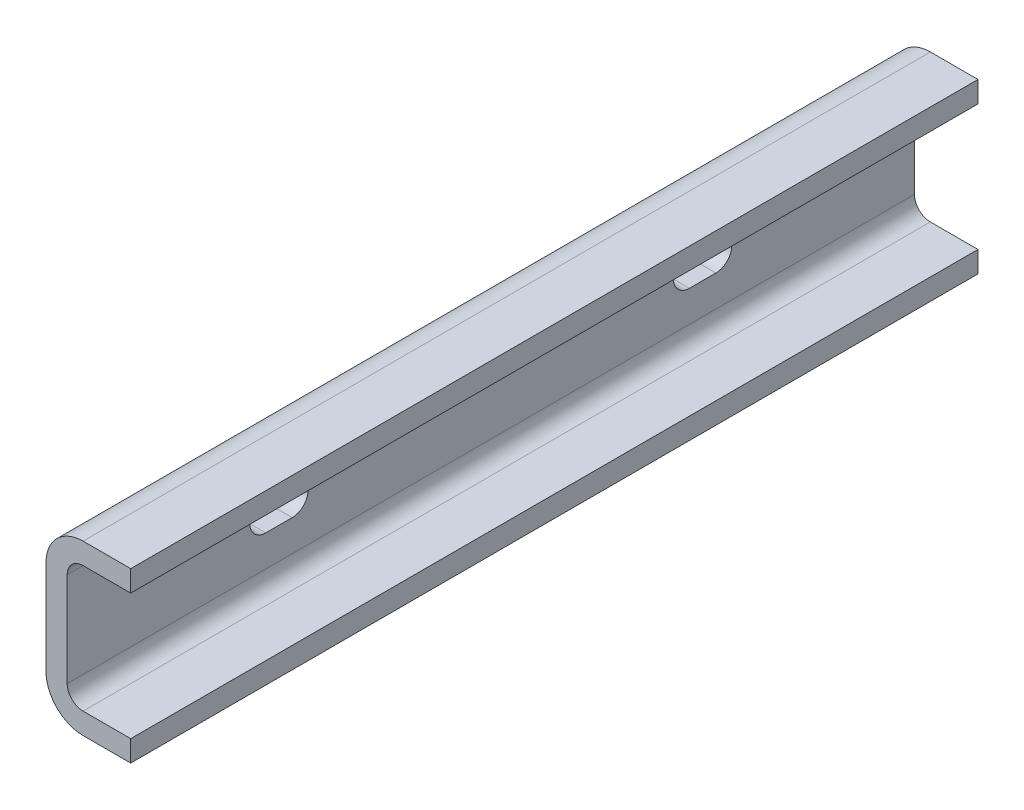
ISO-10303-21;
HEADER;
FILE_DESCRIPTION(('STEP AP214'),'2;1');
FILE_NAME('part.step','',(''),(''),'','','');
FILE_SCHEMA(('AUTOMOTIVE_DESIGN { 1 0 10303 214 1 1 1 1 }'));
ENDSEC;
DATA;
#1=APPLICATION_CONTEXT('core data for automotive mechanical design processes');
#2=APPLICATION_PROTOCOL_DEFINITION('international standard','automotive_design',2000,#1);
#3=PRODUCT_CONTEXT('',#1,'mechanical');
#4=PRODUCT('Part','Part','',(#3));
#5=PRODUCT_RELATED_PRODUCT_CATEGORY('part','',(#4));
#6=PRODUCT_DEFINITION_FORMATION('','',#4);
#7=PRODUCT_DEFINITION_CONTEXT('part definition',#1,'design');
#8=PRODUCT_DEFINITION('design','',#6,#7);
#9=PRODUCT_DEFINITION_SHAPE('','',#8);
#10=(LENGTH_UNIT() NAMED_UNIT(*) SI_UNIT(.MILLI.,.METRE.));
#11=(NAMED_UNIT(*) PLANE_ANGLE_UNIT() SI_UNIT($,.RADIAN.));
#12=(NAMED_UNIT(*) SI_UNIT($,.STERADIAN.) SOLID_ANGLE_UNIT());
#13=UNCERTAINTY_MEASURE_WITH_UNIT(LENGTH_MEASURE(1.E-05),#10,'distance_accuracy_value','');
#14=(GEOMETRIC_REPRESENTATION_CONTEXT(3) GLOBAL_UNCERTAINTY_ASSIGNED_CONTEXT((#13)) GLOBAL_UNIT_ASSIGNED_CONTEXT((#10,
#11,#12)) REPRESENTATION_CONTEXT('',''));
#15=CARTESIAN_POINT('',(0.,0.,0.));
#16=DIRECTION('',(0.,0.,1.));
#17=DIRECTION('',(1.,0.,0.));
#18=AXIS2_PLACEMENT_3D('',#15,#16,#17);
#19=CARTESIAN_POINT('',(7.,11.9,-160.));
#20=DIRECTION('',(0.,-1.,0.));
#21=DIRECTION('',(0.,0.,-1.));
#22=AXIS2_PLACEMENT_3D('',#19,#20,#21);
#23=PLANE('',#22);
#24=DIRECTION('',(1.,0.,0.));
#25=VECTOR('',#24,1.);
#26=CARTESIAN_POINT('',(7.,11.9,0.));
#27=LINE('',#26,#25);
#28=CARTESIAN_POINT('',(7.,11.9,0.));
#29=VERTEX_POINT('',#28);
#30=CARTESIAN_POINT('',(16.,11.9,0.));
#31=VERTEX_POINT('',#30);
#32=EDGE_CURVE('E262',#29,#31,#27,.T.);
#33=ORIENTED_EDGE('',*,*,#32,.F.);
#34=DIRECTION('',(0.,0.,1.));
#35=VECTOR('',#34,1.);
#36=CARTESIAN_POINT('',(7.,11.9,-160.));
#37=LINE('',#36,#35);
#38=CARTESIAN_POINT('',(7.,11.9,-160.));
#39=VERTEX_POINT('',#38);
#40=EDGE_CURVE('E11',#39,#29,#37,.T.);
#41=ORIENTED_EDGE('',*,*,#40,.F.);
#42=DIRECTION('',(1.,0.,0.));
#43=VECTOR('',#42,1.);
#44=CARTESIAN_POINT('',(7.,11.9,-160.));
#45=LINE('',#44,#43);
#46=CARTESIAN_POINT('',(16.,11.9,-160.));
#47=VERTEX_POINT('',#46);
#48=EDGE_CURVE('E272',#39,#47,#45,.T.);
#49=ORIENTED_EDGE('',*,*,#48,.T.);
#50=DIRECTION('',(0.,0.,1.));
#51=VECTOR('',#50,1.);
#52=CARTESIAN_POINT('',(16.,11.9,-160.));
#53=LINE('',#52,#51);
#54=EDGE_CURVE('E42',#47,#31,#53,.T.);
#55=ORIENTED_EDGE('',*,*,#54,.T.);
#56=EDGE_LOOP('',(#33,#41,#49,#55));
#57=FACE_BOUND('',#56,.T.);
#58=ADVANCED_FACE('F39',(#57),#23,.T.);
#59=CARTESIAN_POINT('',(7.00000000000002,8.89999999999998,-160.));
#60=DIRECTION('',(0.,0.,1.));
#61=DIRECTION('',(1.,0.,0.));
#62=AXIS2_PLACEMENT_3D('',#59,#60,#61);
#63=CYLINDRICAL_SURFACE('',#62,3.00000000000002);
#64=CARTESIAN_POINT('',(7.00000000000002,8.89999999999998,0.));
#65=DIRECTION('',(0.,0.,-1.));
#66=DIRECTION('',(-1.,0.,0.));
#67=AXIS2_PLACEMENT_3D('',#64,#65,#66);
#68=CIRCLE('',#67,3.00000000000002);
#69=CARTESIAN_POINT('',(4.,8.89999999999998,0.));
#70=VERTEX_POINT('',#69);
#71=EDGE_CURVE('E277',#70,#29,#68,.T.);
#72=ORIENTED_EDGE('',*,*,#71,.F.);
#73=DIRECTION('',(0.,0.,1.));
#74=VECTOR('',#73,1.);
#75=CARTESIAN_POINT('',(4.,8.89999999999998,-160.));
#76=LINE('',#75,#74);
#77=CARTESIAN_POINT('',(4.,8.89999999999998,-160.));
#78=VERTEX_POINT('',#77);
#79=EDGE_CURVE('E48',#78,#70,#76,.T.);
#80=ORIENTED_EDGE('',*,*,#79,.F.);
#81=CARTESIAN_POINT('',(7.00000000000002,8.89999999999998,-160.));
#82=DIRECTION('',(0.,0.,-1.));
#83=DIRECTION('',(-1.,0.,0.));
#84=AXIS2_PLACEMENT_3D('',#81,#82,#83);
#85=CIRCLE('',#84,3.00000000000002);
#86=EDGE_CURVE('E317',#78,#39,#85,.T.);
#87=ORIENTED_EDGE('',*,*,#86,.T.);
#88=ORIENTED_EDGE('',*,*,#40,.T.);
#89=EDGE_LOOP('',(#72,#80,#87,#88));
#90=FACE_BOUND('',#89,.T.);
#91=ADVANCED_FACE('F406',(#90),#63,.F.);
#92=CARTESIAN_POINT('',(4.,-8.9,-160.));
#93=DIRECTION('',(1.,0.,0.));
#94=DIRECTION('',(0.,0.,-1.));
#95=AXIS2_PLACEMENT_3D('',#92,#93,#94);
#96=PLANE('',#95);
#97=CARTESIAN_POINT('',(4.,0.,-117.5));
#98=DIRECTION('',(1.,0.,0.));
#99=DIRECTION('',(0.,0.,-1.));
#100=AXIS2_PLACEMENT_3D('',#97,#98,#99);
#101=CIRCLE('',#100,3.);
#102=CARTESIAN_POINT('',(4.,3.,-117.5));
#103=VERTEX_POINT('',#102);
#104=CARTESIAN_POINT('',(4.,-3.,-117.5));
#105=VERTEX_POINT('',#104);
#106=EDGE_CURVE('E56',#103,#105,#101,.T.);
#107=ORIENTED_EDGE('',*,*,#106,.F.);
#108=DIRECTION('',(0.,0.,1.));
#109=VECTOR('',#108,1.);
#110=CARTESIAN_POINT('',(4.,3.,-117.5));
#111=LINE('',#110,#109);
#112=CARTESIAN_POINT('',(4.,3.,-122.5));
#113=VERTEX_POINT('',#112);
#114=EDGE_CURVE('E198',#113,#103,#111,.T.);
#115=ORIENTED_EDGE('',*,*,#114,.F.);
#116=CARTESIAN_POINT('',(4.,0.,-122.5));
#117=DIRECTION('',(1.,0.,0.));
#118=DIRECTION('',(0.,0.,1.));
#119=AXIS2_PLACEMENT_3D('',#116,#117,#118);
#120=CIRCLE('',#119,3.);
#121=CARTESIAN_POINT('',(4.,-3.,-122.5));
#122=VERTEX_POINT('',#121);
#123=EDGE_CURVE('E204',#122,#113,#120,.T.);
#124=ORIENTED_EDGE('',*,*,#123,.F.);
#125=DIRECTION('',(0.,0.,-1.));
#126=VECTOR('',#125,1.);
#127=CARTESIAN_POINT('',(4.,-3.,-117.5));
#128=LINE('',#127,#126);
#129=EDGE_CURVE('E213',#105,#122,#128,.T.);
#130=ORIENTED_EDGE('',*,*,#129,.F.);
#131=EDGE_LOOP('',(#107,#115,#124,#130));
#132=FACE_BOUND('',#131,.T.);
#133=CARTESIAN_POINT('',(4.,0.,-37.5));
#134=DIRECTION('',(1.,0.,0.));
#135=DIRECTION('',(0.,0.,-1.));
#136=AXIS2_PLACEMENT_3D('',#133,#134,#135);
#137=CIRCLE('',#136,3.);
#138=CARTESIAN_POINT('',(4.,3.,-37.5));
#139=VERTEX_POINT('',#138);
#140=CARTESIAN_POINT('',(4.,-3.,-37.5));
#141=VERTEX_POINT('',#140);
#142=EDGE_CURVE('E222',#139,#141,#137,.T.);
#143=ORIENTED_EDGE('',*,*,#142,.F.);
#144=DIRECTION('',(0.,0.,1.));
#145=VECTOR('',#144,1.);
#146=CARTESIAN_POINT('',(4.,3.,-37.5));
#147=LINE('',#146,#145);
#148=CARTESIAN_POINT('',(4.,3.,-42.5));
#149=VERTEX_POINT('',#148);
#150=EDGE_CURVE('E233',#149,#139,#147,.T.);
#151=ORIENTED_EDGE('',*,*,#150,.F.);
#152=CARTESIAN_POINT('',(4.,0.,-42.5));
#153=DIRECTION('',(1.,0.,0.));
#154=DIRECTION('',(0.,0.,1.));
#155=AXIS2_PLACEMENT_3D('',#152,#153,#154);
#156=CIRCLE('',#155,3.);
#157=CARTESIAN_POINT('',(4.,-3.,-42.5));
#158=VERTEX_POINT('',#157);
#159=EDGE_CURVE('E252',#158,#149,#156,.T.);
#160=ORIENTED_EDGE('',*,*,#159,.F.);
#161=DIRECTION('',(0.,0.,-1.));
#162=VECTOR('',#161,1.);
#163=CARTESIAN_POINT('',(4.,-3.,-37.5));
#164=LINE('',#163,#162);
#165=EDGE_CURVE('E248',#141,#158,#164,.T.);
#166=ORIENTED_EDGE('',*,*,#165,.F.);
#167=EDGE_LOOP('',(#143,#151,#160,#166));
#168=FACE_BOUND('',#167,.T.);
#169=DIRECTION('',(0.,1.,0.));
#170=VECTOR('',#169,1.);
#171=CARTESIAN_POINT('',(4.,-8.9,0.));
#172=LINE('',#171,#170);
#173=CARTESIAN_POINT('',(4.,-8.9,0.));
#174=VERTEX_POINT('',#173);
#175=EDGE_CURVE('E360',#174,#70,#172,.T.);
#176=ORIENTED_EDGE('',*,*,#175,.F.);
#177=DIRECTION('',(0.,0.,1.));
#178=VECTOR('',#177,1.);
#179=CARTESIAN_POINT('',(4.,-8.9,-160.));
#180=LINE('',#179,#178);
#181=CARTESIAN_POINT('',(4.,-8.9,-160.));
#182=VERTEX_POINT('',#181);
#183=EDGE_CURVE('E368',#182,#174,#180,.T.);
#184=ORIENTED_EDGE('',*,*,#183,.F.);
#185=DIRECTION('',(0.,1.,0.));
#186=VECTOR('',#185,1.);
#187=CARTESIAN_POINT('',(4.,-8.9,-160.));
#188=LINE('',#187,#186);
#189=EDGE_CURVE('E313',#182,#78,#188,.T.);
#190=ORIENTED_EDGE('',*,*,#189,.T.);
#191=ORIENTED_EDGE('',*,*,#79,.T.);
#192=EDGE_LOOP('',(#176,#184,#190,#191));
#193=FACE_BOUND('',#192,.T.);
#194=ADVANCED_FACE('F442',(#132,#168,#193),#96,.T.);
#195=CARTESIAN_POINT('',(7.,-8.9,-160.));
#196=DIRECTION('',(0.,0.,1.));
#197=DIRECTION('',(1.,0.,0.));
#198=AXIS2_PLACEMENT_3D('',#195,#196,#197);
#199=CYLINDRICAL_SURFACE('',#198,3.);
#200=CARTESIAN_POINT('',(7.,-8.9,0.));
#201=DIRECTION('',(0.,0.,-1.));
#202=DIRECTION('',(-1.,0.,0.));
#203=AXIS2_PLACEMENT_3D('',#200,#201,#202);
#204=CIRCLE('',#203,3.);
#205=CARTESIAN_POINT('',(7.,-11.9,0.));
#206=VERTEX_POINT('',#205);
#207=EDGE_CURVE('E356',#206,#174,#204,.T.);
#208=ORIENTED_EDGE('',*,*,#207,.F.);
#209=DIRECTION('',(0.,0.,1.));
#210=VECTOR('',#209,1.);
#211=CARTESIAN_POINT('',(7.,-11.9,-160.));
#212=LINE('',#211,#210);
#213=CARTESIAN_POINT('',(7.,-11.9,-160.));
#214=VERTEX_POINT('',#213);
#215=EDGE_CURVE('E371',#214,#206,#212,.T.);
#216=ORIENTED_EDGE('',*,*,#215,.F.);
#217=CARTESIAN_POINT('',(7.,-8.9,-160.));
#218=DIRECTION('',(0.,0.,-1.));
#219=DIRECTION('',(-1.,0.,0.));
#220=AXIS2_PLACEMENT_3D('',#217,#218,#219);
#221=CIRCLE('',#220,3.);
#222=EDGE_CURVE('E309',#214,#182,#221,.T.);
#223=ORIENTED_EDGE('',*,*,#222,.T.);
#224=ORIENTED_EDGE('',*,*,#183,.T.);
#225=EDGE_LOOP('',(#208,#216,#223,#224));
#226=FACE_BOUND('',#225,.T.);
#227=ADVANCED_FACE('F439',(#226),#199,.F.);
#228=CARTESIAN_POINT('',(16.,-11.9,-160.));
#229=DIRECTION('',(0.,1.,0.));
#230=DIRECTION('',(0.,0.,1.));
#231=AXIS2_PLACEMENT_3D('',#228,#229,#230);
#232=PLANE('',#231);
#233=DIRECTION('',(-1.,0.,0.));
#234=VECTOR('',#233,1.);
#235=CARTESIAN_POINT('',(16.,-11.9,0.));
#236=LINE('',#235,#234);
#237=CARTESIAN_POINT('',(16.,-11.9,0.));
#238=VERTEX_POINT('',#237);
#239=EDGE_CURVE('E352',#238,#206,#236,.T.);
#240=ORIENTED_EDGE('',*,*,#239,.F.);
#241=DIRECTION('',(0.,0.,1.));
#242=VECTOR('',#241,1.);
#243=CARTESIAN_POINT('',(16.,-11.9,-160.));
#244=LINE('',#243,#242);
#245=CARTESIAN_POINT('',(16.,-11.9,-160.));
#246=VERTEX_POINT('',#245);
#247=EDGE_CURVE('E374',#246,#238,#244,.T.);
#248=ORIENTED_EDGE('',*,*,#247,.F.);
#249=DIRECTION('',(-1.,0.,0.));
#250=VECTOR('',#249,1.);
#251=CARTESIAN_POINT('',(16.,-11.9,-160.));
#252=LINE('',#251,#250);
#253=EDGE_CURVE('E305',#246,#214,#252,.T.);
#254=ORIENTED_EDGE('',*,*,#253,.T.);
#255=ORIENTED_EDGE('',*,*,#215,.T.);
#256=EDGE_LOOP('',(#240,#248,#254,#255));
#257=FACE_BOUND('',#256,.T.);
#258=ADVANCED_FACE('F436',(#257),#232,.T.);
#259=CARTESIAN_POINT('',(16.,-15.9,-160.));
#260=DIRECTION('',(1.,0.,0.));
#261=DIRECTION('',(0.,0.,-1.));
#262=AXIS2_PLACEMENT_3D('',#259,#260,#261);
#263=PLANE('',#262);
#264=DIRECTION('',(0.,1.,0.));
#265=VECTOR('',#264,1.);
#266=CARTESIAN_POINT('',(16.,-15.9,0.));
#267=LINE('',#266,#265);
#268=CARTESIAN_POINT('',(16.,-15.9,0.));
#269=VERTEX_POINT('',#268);
#270=EDGE_CURVE('E348',#269,#238,#267,.T.);
#271=ORIENTED_EDGE('',*,*,#270,.F.);
#272=DIRECTION('',(0.,0.,1.));
#273=VECTOR('',#272,1.);
#274=CARTESIAN_POINT('',(16.,-15.9,-160.));
#275=LINE('',#274,#273);
#276=CARTESIAN_POINT('',(16.,-15.9,-160.));
#277=VERTEX_POINT('',#276);
#278=EDGE_CURVE('E377',#277,#269,#275,.T.);
#279=ORIENTED_EDGE('',*,*,#278,.F.);
#280=DIRECTION('',(0.,1.,0.));
#281=VECTOR('',#280,1.);
#282=CARTESIAN_POINT('',(16.,-15.9,-160.));
#283=LINE('',#282,#281);
#284=EDGE_CURVE('E301',#277,#246,#283,.T.);
#285=ORIENTED_EDGE('',*,*,#284,.T.);
#286=ORIENTED_EDGE('',*,*,#247,.T.);
#287=EDGE_LOOP('',(#271,#279,#285,#286));
#288=FACE_BOUND('',#287,.T.);
#289=ADVANCED_FACE('F432',(#288),#263,.T.);
#290=CARTESIAN_POINT('',(7.,-15.9,-160.));
#291=DIRECTION('',(0.,-1.,0.));
#292=DIRECTION('',(0.,0.,-1.));
#293=AXIS2_PLACEMENT_3D('',#290,#291,#292);
#294=PLANE('',#293);
#295=DIRECTION('',(1.,0.,0.));
#296=VECTOR('',#295,1.);
#297=CARTESIAN_POINT('',(7.,-15.9,0.));
#298=LINE('',#297,#296);
#299=CARTESIAN_POINT('',(7.,-15.9,0.));
#300=VERTEX_POINT('',#299);
#301=EDGE_CURVE('E344',#300,#269,#298,.T.);
#302=ORIENTED_EDGE('',*,*,#301,.F.);
#303=DIRECTION('',(0.,0.,1.));
#304=VECTOR('',#303,1.);
#305=CARTESIAN_POINT('',(7.,-15.9,-160.));
#306=LINE('',#305,#304);
#307=CARTESIAN_POINT('',(7.,-15.9,-160.));
#308=VERTEX_POINT('',#307);
#309=EDGE_CURVE('E380',#308,#300,#306,.T.);
#310=ORIENTED_EDGE('',*,*,#309,.F.);
#311=DIRECTION('',(1.,0.,0.));
#312=VECTOR('',#311,1.);
#313=CARTESIAN_POINT('',(7.,-15.9,-160.));
#314=LINE('',#313,#312);
#315=EDGE_CURVE('E297',#308,#277,#314,.T.);
#316=ORIENTED_EDGE('',*,*,#315,.T.);
#317=ORIENTED_EDGE('',*,*,#278,.T.);
#318=EDGE_LOOP('',(#302,#310,#316,#317));
#319=FACE_BOUND('',#318,.T.);
#320=ADVANCED_FACE('F428',(#319),#294,.T.);
#321=CARTESIAN_POINT('',(6.99999999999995,-8.90000000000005,-160.));
#322=DIRECTION('',(0.,0.,1.));
#323=DIRECTION('',(1.,0.,0.));
#324=AXIS2_PLACEMENT_3D('',#321,#322,#323);
#325=CYLINDRICAL_SURFACE('',#324,6.99999999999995);
#326=CARTESIAN_POINT('',(6.99999999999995,-8.90000000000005,0.));
#327=DIRECTION('',(0.,0.,1.));
#328=DIRECTION('',(1.,0.,0.));
#329=AXIS2_PLACEMENT_3D('',#326,#327,#328);
#330=CIRCLE('',#329,6.99999999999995);
#331=CARTESIAN_POINT('',(0.,-8.90000000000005,0.));
#332=VERTEX_POINT('',#331);
#333=EDGE_CURVE('E340',#332,#300,#330,.T.);
#334=ORIENTED_EDGE('',*,*,#333,.F.);
#335=DIRECTION('',(0.,0.,1.));
#336=VECTOR('',#335,1.);
#337=CARTESIAN_POINT('',(0.,-8.90000000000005,-160.));
#338=LINE('',#337,#336);
#339=CARTESIAN_POINT('',(0.,-8.90000000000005,-160.));
#340=VERTEX_POINT('',#339);
#341=EDGE_CURVE('E383',#340,#332,#338,.T.);
#342=ORIENTED_EDGE('',*,*,#341,.F.);
#343=CARTESIAN_POINT('',(6.99999999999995,-8.90000000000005,-160.));
#344=DIRECTION('',(0.,0.,1.));
#345=DIRECTION('',(1.,0.,0.));
#346=AXIS2_PLACEMENT_3D('',#343,#344,#345);
#347=CIRCLE('',#346,6.99999999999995);
#348=EDGE_CURVE('E293',#340,#308,#347,.T.);
#349=ORIENTED_EDGE('',*,*,#348,.T.);
#350=ORIENTED_EDGE('',*,*,#309,.T.);
#351=EDGE_LOOP('',(#334,#342,#349,#350));
#352=FACE_BOUND('',#351,.T.);
#353=ADVANCED_FACE('F424',(#352),#325,.T.);
#354=CARTESIAN_POINT('',(0.,8.9,-160.));
#355=DIRECTION('',(-1.,0.,0.));
#356=DIRECTION('',(0.,-1.,0.));
#357=AXIS2_PLACEMENT_3D('',#354,#355,#356);
#358=PLANE('',#357);
#359=CARTESIAN_POINT('',(0.,0.,-117.5));
#360=DIRECTION('',(1.,0.,0.));
#361=DIRECTION('',(0.,0.,-1.));
#362=AXIS2_PLACEMENT_3D('',#359,#360,#361);
#363=CIRCLE('',#362,3.);
#364=CARTESIAN_POINT('',(0.,3.,-117.5));
#365=VERTEX_POINT('',#364);
#366=CARTESIAN_POINT('',(0.,-3.,-117.5));
#367=VERTEX_POINT('',#366);
#368=EDGE_CURVE('E179',#365,#367,#363,.T.);
#369=ORIENTED_EDGE('',*,*,#368,.T.);
#370=DIRECTION('',(0.,0.,-1.));
#371=VECTOR('',#370,1.);
#372=CARTESIAN_POINT('',(0.,-3.,-117.5));
#373=LINE('',#372,#371);
#374=CARTESIAN_POINT('',(0.,-3.,-122.5));
#375=VERTEX_POINT('',#374);
#376=EDGE_CURVE('E189',#367,#375,#373,.T.);
#377=ORIENTED_EDGE('',*,*,#376,.T.);
#378=CARTESIAN_POINT('',(0.,0.,-122.5));
#379=DIRECTION('',(1.,0.,0.));
#380=DIRECTION('',(0.,0.,1.));
#381=AXIS2_PLACEMENT_3D('',#378,#379,#380);
#382=CIRCLE('',#381,3.);
#383=CARTESIAN_POINT('',(0.,3.,-122.5));
#384=VERTEX_POINT('',#383);
#385=EDGE_CURVE('E64',#375,#384,#382,.T.);
#386=ORIENTED_EDGE('',*,*,#385,.T.);
#387=DIRECTION('',(0.,0.,1.));
#388=VECTOR('',#387,1.);
#389=CARTESIAN_POINT('',(0.,3.,-117.5));
#390=LINE('',#389,#388);
#391=EDGE_CURVE('E186',#384,#365,#390,.T.);
#392=ORIENTED_EDGE('',*,*,#391,.T.);
#393=EDGE_LOOP('',(#369,#377,#386,#392));
#394=FACE_BOUND('',#393,.T.);
#395=CARTESIAN_POINT('',(0.,0.,-37.5));
#396=DIRECTION('',(1.,0.,0.));
#397=DIRECTION('',(0.,0.,-1.));
#398=AXIS2_PLACEMENT_3D('',#395,#396,#397);
#399=CIRCLE('',#398,3.);
#400=CARTESIAN_POINT('',(0.,3.,-37.5));
#401=VERTEX_POINT('',#400);
#402=CARTESIAN_POINT('',(0.,-3.,-37.5));
#403=VERTEX_POINT('',#402);
#404=EDGE_CURVE('E228',#401,#403,#399,.T.);
#405=ORIENTED_EDGE('',*,*,#404,.T.);
#406=DIRECTION('',(0.,0.,-1.));
#407=VECTOR('',#406,1.);
#408=CARTESIAN_POINT('',(0.,-3.,-37.5));
#409=LINE('',#408,#407);
#410=CARTESIAN_POINT('',(0.,-3.,-42.5));
#411=VERTEX_POINT('',#410);
#412=EDGE_CURVE('E232',#403,#411,#409,.T.);
#413=ORIENTED_EDGE('',*,*,#412,.T.);
#414=CARTESIAN_POINT('',(0.,0.,-42.5));
#415=DIRECTION('',(1.,0.,0.));
#416=DIRECTION('',(0.,0.,1.));
#417=AXIS2_PLACEMENT_3D('',#414,#415,#416);
#418=CIRCLE('',#417,3.);
#419=CARTESIAN_POINT('',(0.,3.,-42.5));
#420=VERTEX_POINT('',#419);
#421=EDGE_CURVE('E237',#411,#420,#418,.T.);
#422=ORIENTED_EDGE('',*,*,#421,.T.);
#423=DIRECTION('',(0.,0.,1.));
#424=VECTOR('',#423,1.);
#425=CARTESIAN_POINT('',(0.,3.,-37.5));
#426=LINE('',#425,#424);
#427=EDGE_CURVE('E241',#420,#401,#426,.T.);
#428=ORIENTED_EDGE('',*,*,#427,.T.);
#429=EDGE_LOOP('',(#405,#413,#422,#428));
#430=FACE_BOUND('',#429,.T.);
#431=DIRECTION('',(0.,-1.,0.));
#432=VECTOR('',#431,1.);
#433=CARTESIAN_POINT('',(0.,8.9,0.));
#434=LINE('',#433,#432);
#435=CARTESIAN_POINT('',(0.,8.9,0.));
#436=VERTEX_POINT('',#435);
#437=EDGE_CURVE('E336',#436,#332,#434,.T.);
#438=ORIENTED_EDGE('',*,*,#437,.F.);
#439=DIRECTION('',(0.,0.,1.));
#440=VECTOR('',#439,1.);
#441=CARTESIAN_POINT('',(0.,8.9,-160.));
#442=LINE('',#441,#440);
#443=CARTESIAN_POINT('',(0.,8.9,-160.));
#444=VERTEX_POINT('',#443);
#445=EDGE_CURVE('E386',#444,#436,#442,.T.);
#446=ORIENTED_EDGE('',*,*,#445,.F.);
#447=DIRECTION('',(0.,-1.,0.));
#448=VECTOR('',#447,1.);
#449=CARTESIAN_POINT('',(0.,8.9,-160.));
#450=LINE('',#449,#448);
#451=EDGE_CURVE('E289',#444,#340,#450,.T.);
#452=ORIENTED_EDGE('',*,*,#451,.T.);
#453=ORIENTED_EDGE('',*,*,#341,.T.);
#454=EDGE_LOOP('',(#438,#446,#452,#453));
#455=FACE_BOUND('',#454,.T.);
#456=ADVANCED_FACE('F194',(#394,#430,#455),#358,.T.);
#457=CARTESIAN_POINT('',(7.,8.9,-160.));
#458=DIRECTION('',(0.,0.,1.));
#459=DIRECTION('',(1.,0.,0.));
#460=AXIS2_PLACEMENT_3D('',#457,#458,#459);
#461=CYLINDRICAL_SURFACE('',#460,7.);
#462=CARTESIAN_POINT('',(7.,8.9,0.));
#463=DIRECTION('',(0.,0.,1.));
#464=DIRECTION('',(1.,0.,0.));
#465=AXIS2_PLACEMENT_3D('',#462,#463,#464);
#466=CIRCLE('',#465,7.);
#467=CARTESIAN_POINT('',(7.,15.9,0.));
#468=VERTEX_POINT('',#467);
#469=EDGE_CURVE('E332',#468,#436,#466,.T.);
#470=ORIENTED_EDGE('',*,*,#469,.F.);
#471=DIRECTION('',(0.,0.,1.));
#472=VECTOR('',#471,1.);
#473=CARTESIAN_POINT('',(7.,15.9,-160.));
#474=LINE('',#473,#472);
#475=CARTESIAN_POINT('',(7.,15.9,-160.));
#476=VERTEX_POINT('',#475);
#477=EDGE_CURVE('E388',#476,#468,#474,.T.);
#478=ORIENTED_EDGE('',*,*,#477,.F.);
#479=CARTESIAN_POINT('',(7.,8.9,-160.));
#480=DIRECTION('',(0.,0.,1.));
#481=DIRECTION('',(1.,0.,0.));
#482=AXIS2_PLACEMENT_3D('',#479,#480,#481);
#483=CIRCLE('',#482,7.);
#484=EDGE_CURVE('E285',#476,#444,#483,.T.);
#485=ORIENTED_EDGE('',*,*,#484,.T.);
#486=ORIENTED_EDGE('',*,*,#445,.T.);
#487=EDGE_LOOP('',(#470,#478,#485,#486));
#488=FACE_BOUND('',#487,.T.);
#489=ADVANCED_FACE('F419',(#488),#461,.T.);
#490=CARTESIAN_POINT('',(16.,15.9,-160.));
#491=DIRECTION('',(0.,1.,0.));
#492=DIRECTION('',(0.,0.,1.));
#493=AXIS2_PLACEMENT_3D('',#490,#491,#492);
#494=PLANE('',#493);
#495=DIRECTION('',(-1.,0.,0.));
#496=VECTOR('',#495,1.);
#497=CARTESIAN_POINT('',(16.,15.9,0.));
#498=LINE('',#497,#496);
#499=CARTESIAN_POINT('',(16.,15.9,0.));
#500=VERTEX_POINT('',#499);
#501=EDGE_CURVE('E328',#500,#468,#498,.T.);
#502=ORIENTED_EDGE('',*,*,#501,.F.);
#503=DIRECTION('',(0.,0.,1.));
#504=VECTOR('',#503,1.);
#505=CARTESIAN_POINT('',(16.,15.9,-160.));
#506=LINE('',#505,#504);
#507=CARTESIAN_POINT('',(16.,15.9,-160.));
#508=VERTEX_POINT('',#507);
#509=EDGE_CURVE('E390',#508,#500,#506,.T.);
#510=ORIENTED_EDGE('',*,*,#509,.F.);
#511=DIRECTION('',(-1.,0.,0.));
#512=VECTOR('',#511,1.);
#513=CARTESIAN_POINT('',(16.,15.9,-160.));
#514=LINE('',#513,#512);
#515=EDGE_CURVE('E281',#508,#476,#514,.T.);
#516=ORIENTED_EDGE('',*,*,#515,.T.);
#517=ORIENTED_EDGE('',*,*,#477,.T.);
#518=EDGE_LOOP('',(#502,#510,#516,#517));
#519=FACE_BOUND('',#518,.T.);
#520=ADVANCED_FACE('F415',(#519),#494,.T.);
#521=CARTESIAN_POINT('',(16.,11.9,-160.));
#522=DIRECTION('',(1.,0.,0.));
#523=DIRECTION('',(0.,0.,-1.));
#524=AXIS2_PLACEMENT_3D('',#521,#522,#523);
#525=PLANE('',#524);
#526=DIRECTION('',(0.,1.,0.));
#527=VECTOR('',#526,1.);
#528=CARTESIAN_POINT('',(16.,11.9,0.));
#529=LINE('',#528,#527);
#530=EDGE_CURVE('E324',#31,#500,#529,.T.);
#531=ORIENTED_EDGE('',*,*,#530,.F.);
#532=ORIENTED_EDGE('',*,*,#54,.F.);
#533=DIRECTION('',(0.,1.,0.));
#534=VECTOR('',#533,1.);
#535=CARTESIAN_POINT('',(16.,11.9,-160.));
#536=LINE('',#535,#534);
#537=EDGE_CURVE('E276',#47,#508,#536,.T.);
#538=ORIENTED_EDGE('',*,*,#537,.T.);
#539=ORIENTED_EDGE('',*,*,#509,.T.);
#540=EDGE_LOOP('',(#531,#532,#538,#539));
#541=FACE_BOUND('',#540,.T.);
#542=ADVANCED_FACE('F400',(#541),#525,.T.);
#543=CARTESIAN_POINT('',(7.,8.9,-160.));
#544=DIRECTION('',(0.,0.,1.));
#545=DIRECTION('',(1.,0.,0.));
#546=AXIS2_PLACEMENT_3D('',#543,#544,#545);
#547=PLANE('',#546);
#548=ORIENTED_EDGE('',*,*,#48,.F.);
#549=ORIENTED_EDGE('',*,*,#86,.F.);
#550=ORIENTED_EDGE('',*,*,#189,.F.);
#551=ORIENTED_EDGE('',*,*,#222,.F.);
#552=ORIENTED_EDGE('',*,*,#253,.F.);
#553=ORIENTED_EDGE('',*,*,#284,.F.);
#554=ORIENTED_EDGE('',*,*,#315,.F.);
#555=ORIENTED_EDGE('',*,*,#348,.F.);
#556=ORIENTED_EDGE('',*,*,#451,.F.);
#557=ORIENTED_EDGE('',*,*,#484,.F.);
#558=ORIENTED_EDGE('',*,*,#515,.F.);
#559=ORIENTED_EDGE('',*,*,#537,.F.);
#560=EDGE_LOOP('',(#548,#549,#550,#551,#552,#553,#554,#555,#556,#557,#558,#559));
#561=FACE_BOUND('',#560,.T.);
#562=ADVANCED_FACE('F409',(#561),#547,.F.);
#563=CARTESIAN_POINT('',(7.,8.9,0.));
#564=DIRECTION('',(0.,0.,1.));
#565=DIRECTION('',(1.,0.,0.));
#566=AXIS2_PLACEMENT_3D('',#563,#564,#565);
#567=PLANE('',#566);
#568=ORIENTED_EDGE('',*,*,#32,.T.);
#569=ORIENTED_EDGE('',*,*,#530,.T.);
#570=ORIENTED_EDGE('',*,*,#501,.T.);
#571=ORIENTED_EDGE('',*,*,#469,.T.);
#572=ORIENTED_EDGE('',*,*,#437,.T.);
#573=ORIENTED_EDGE('',*,*,#333,.T.);
#574=ORIENTED_EDGE('',*,*,#301,.T.);
#575=ORIENTED_EDGE('',*,*,#270,.T.);
#576=ORIENTED_EDGE('',*,*,#239,.T.);
#577=ORIENTED_EDGE('',*,*,#207,.T.);
#578=ORIENTED_EDGE('',*,*,#175,.T.);
#579=ORIENTED_EDGE('',*,*,#71,.T.);
#580=EDGE_LOOP('',(#568,#569,#570,#571,#572,#573,#574,#575,#576,#577,#578,#579));
#581=FACE_BOUND('',#580,.T.);
#582=ADVANCED_FACE('F402',(#581),#567,.T.);
#583=CARTESIAN_POINT('',(0.,0.,-37.5));
#584=DIRECTION('',(1.,0.,0.));
#585=DIRECTION('',(0.,0.,-1.));
#586=AXIS2_PLACEMENT_3D('',#583,#584,#585);
#587=CYLINDRICAL_SURFACE('',#586,3.);
#588=ORIENTED_EDGE('',*,*,#142,.T.);
#589=DIRECTION('',(1.,0.,0.));
#590=VECTOR('',#589,1.);
#591=CARTESIAN_POINT('',(0.,-3.,-37.5));
#592=LINE('',#591,#590);
#593=EDGE_CURVE('E245',#403,#141,#592,.T.);
#594=ORIENTED_EDGE('',*,*,#593,.F.);
#595=ORIENTED_EDGE('',*,*,#404,.F.);
#596=DIRECTION('',(1.,0.,0.));
#597=VECTOR('',#596,1.);
#598=CARTESIAN_POINT('',(0.,3.,-37.5));
#599=LINE('',#598,#597);
#600=EDGE_CURVE('E259',#401,#139,#599,.T.);
#601=ORIENTED_EDGE('',*,*,#600,.T.);
#602=EDGE_LOOP('',(#588,#594,#595,#601));
#603=FACE_BOUND('',#602,.T.);
#604=ADVANCED_FACE('F538',(#603),#587,.F.);
#605=CARTESIAN_POINT('',(0.,3.,-37.5));
#606=DIRECTION('',(0.,1.,0.));
#607=DIRECTION('',(0.,0.,1.));
#608=AXIS2_PLACEMENT_3D('',#605,#606,#607);
#609=PLANE('',#608);
#610=ORIENTED_EDGE('',*,*,#150,.T.);
#611=ORIENTED_EDGE('',*,*,#600,.F.);
#612=ORIENTED_EDGE('',*,*,#427,.F.);
#613=DIRECTION('',(1.,0.,0.));
#614=VECTOR('',#613,1.);
#615=CARTESIAN_POINT('',(0.,3.,-42.5));
#616=LINE('',#615,#614);
#617=EDGE_CURVE('E263',#420,#149,#616,.T.);
#618=ORIENTED_EDGE('',*,*,#617,.T.);
#619=EDGE_LOOP('',(#610,#611,#612,#618));
#620=FACE_BOUND('',#619,.T.);
#621=ADVANCED_FACE('F546',(#620),#609,.F.);
#622=CARTESIAN_POINT('',(0.,0.,-42.5));
#623=DIRECTION('',(1.,0.,0.));
#624=DIRECTION('',(0.,0.,-1.));
#625=AXIS2_PLACEMENT_3D('',#622,#623,#624);
#626=CYLINDRICAL_SURFACE('',#625,3.);
#627=ORIENTED_EDGE('',*,*,#159,.T.);
#628=ORIENTED_EDGE('',*,*,#617,.F.);
#629=ORIENTED_EDGE('',*,*,#421,.F.);
#630=DIRECTION('',(1.,0.,0.));
#631=VECTOR('',#630,1.);
#632=CARTESIAN_POINT('',(0.,-3.,-42.5));
#633=LINE('',#632,#631);
#634=EDGE_CURVE('E266',#411,#158,#633,.T.);
#635=ORIENTED_EDGE('',*,*,#634,.T.);
#636=EDGE_LOOP('',(#627,#628,#629,#635));
#637=FACE_BOUND('',#636,.T.);
#638=ADVANCED_FACE('F555',(#637),#626,.F.);
#639=CARTESIAN_POINT('',(0.,-3.,-37.5));
#640=DIRECTION('',(0.,-1.,0.));
#641=DIRECTION('',(0.,0.,-1.));
#642=AXIS2_PLACEMENT_3D('',#639,#640,#641);
#643=PLANE('',#642);
#644=ORIENTED_EDGE('',*,*,#165,.T.);
#645=ORIENTED_EDGE('',*,*,#634,.F.);
#646=ORIENTED_EDGE('',*,*,#412,.F.);
#647=ORIENTED_EDGE('',*,*,#593,.T.);
#648=EDGE_LOOP('',(#644,#645,#646,#647));
#649=FACE_BOUND('',#648,.T.);
#650=ADVANCED_FACE('F564',(#649),#643,.F.);
#651=CARTESIAN_POINT('',(0.,0.,-117.5));
#652=DIRECTION('',(1.,0.,0.));
#653=DIRECTION('',(0.,0.,-1.));
#654=AXIS2_PLACEMENT_3D('',#651,#652,#653);
#655=CYLINDRICAL_SURFACE('',#654,3.);
#656=ORIENTED_EDGE('',*,*,#106,.T.);
#657=DIRECTION('',(1.,0.,0.));
#658=VECTOR('',#657,1.);
#659=CARTESIAN_POINT('',(0.,-3.,-117.5));
#660=LINE('',#659,#658);
#661=EDGE_CURVE('E175',#367,#105,#660,.T.);
#662=ORIENTED_EDGE('',*,*,#661,.F.);
#663=ORIENTED_EDGE('',*,*,#368,.F.);
#664=DIRECTION('',(1.,0.,0.));
#665=VECTOR('',#664,1.);
#666=CARTESIAN_POINT('',(0.,3.,-117.5));
#667=LINE('',#666,#665);
#668=EDGE_CURVE('E219',#365,#103,#667,.T.);
#669=ORIENTED_EDGE('',*,*,#668,.T.);
#670=EDGE_LOOP('',(#656,#662,#663,#669));
#671=FACE_BOUND('',#670,.T.);
#672=ADVANCED_FACE('F177',(#671),#655,.F.);
#673=CARTESIAN_POINT('',(0.,3.,-117.5));
#674=DIRECTION('',(0.,1.,0.));
#675=DIRECTION('',(0.,0.,1.));
#676=AXIS2_PLACEMENT_3D('',#673,#674,#675);
#677=PLANE('',#676);
#678=ORIENTED_EDGE('',*,*,#114,.T.);
#679=ORIENTED_EDGE('',*,*,#668,.F.);
#680=ORIENTED_EDGE('',*,*,#391,.F.);
#681=DIRECTION('',(1.,0.,0.));
#682=VECTOR('',#681,1.);
#683=CARTESIAN_POINT('',(0.,3.,-122.5));
#684=LINE('',#683,#682);
#685=EDGE_CURVE('E223',#384,#113,#684,.T.);
#686=ORIENTED_EDGE('',*,*,#685,.T.);
#687=EDGE_LOOP('',(#678,#679,#680,#686));
#688=FACE_BOUND('',#687,.T.);
#689=ADVANCED_FACE('F579',(#688),#677,.F.);
#690=CARTESIAN_POINT('',(0.,0.,-122.5));
#691=DIRECTION('',(1.,0.,0.));
#692=DIRECTION('',(0.,0.,-1.));
#693=AXIS2_PLACEMENT_3D('',#690,#691,#692);
#694=CYLINDRICAL_SURFACE('',#693,3.);
#695=ORIENTED_EDGE('',*,*,#123,.T.);
#696=ORIENTED_EDGE('',*,*,#685,.F.);
#697=ORIENTED_EDGE('',*,*,#385,.F.);
#698=DIRECTION('',(1.,0.,0.));
#699=VECTOR('',#698,1.);
#700=CARTESIAN_POINT('',(0.,-3.,-122.5));
#701=LINE('',#700,#699);
#702=EDGE_CURVE('E185',#375,#122,#701,.T.);
#703=ORIENTED_EDGE('',*,*,#702,.T.);
#704=EDGE_LOOP('',(#695,#696,#697,#703));
#705=FACE_BOUND('',#704,.T.);
#706=ADVANCED_FACE('F587',(#705),#694,.F.);
#707=CARTESIAN_POINT('',(0.,-3.,-117.5));
#708=DIRECTION('',(0.,-1.,0.));
#709=DIRECTION('',(0.,0.,-1.));
#710=AXIS2_PLACEMENT_3D('',#707,#708,#709);
#711=PLANE('',#710);
#712=ORIENTED_EDGE('',*,*,#129,.T.);
#713=ORIENTED_EDGE('',*,*,#702,.F.);
#714=ORIENTED_EDGE('',*,*,#376,.F.);
#715=ORIENTED_EDGE('',*,*,#661,.T.);
#716=EDGE_LOOP('',(#712,#713,#714,#715));
#717=FACE_BOUND('',#716,.T.);
#718=ADVANCED_FACE('F190',(#717),#711,.F.);
#719=CLOSED_SHELL('',(#58,#91,#194,#227,#258,#289,#320,#353,#456,#489,#520,#542,#562,#582,#604,
#621,#638,#650,#672,#689,#706,#718));
#720=MANIFOLD_SOLID_BREP('B2',#719);
#721=ADVANCED_BREP_SHAPE_REPRESENTATION('',(#18,#720),#14);
#722=SHAPE_DEFINITION_REPRESENTATION(#9,#721);
ENDSEC;
END-ISO-10303-21;
